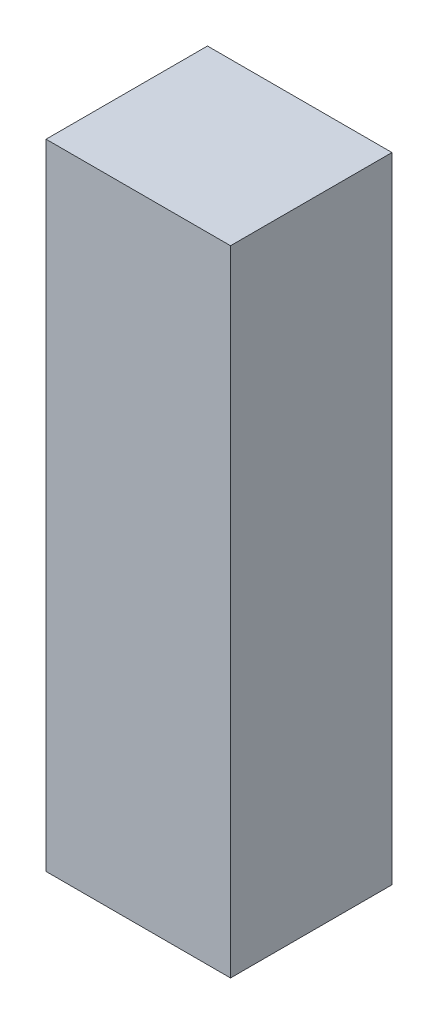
ISO-10303-21;
HEADER;
FILE_DESCRIPTION(('STEP AP214'),'2;1');
FILE_NAME('part.step','',(''),(''),'','','');
FILE_SCHEMA(('AUTOMOTIVE_DESIGN { 1 0 10303 214 1 1 1 1 }'));
ENDSEC;
DATA;
#1=APPLICATION_CONTEXT('core data for automotive mechanical design processes');
#2=APPLICATION_PROTOCOL_DEFINITION('international standard','automotive_design',2000,#1);
#3=PRODUCT_CONTEXT('',#1,'mechanical');
#4=PRODUCT('Part','Part','',(#3));
#5=PRODUCT_RELATED_PRODUCT_CATEGORY('part','',(#4));
#6=PRODUCT_DEFINITION_FORMATION('','',#4);
#7=PRODUCT_DEFINITION_CONTEXT('part definition',#1,'design');
#8=PRODUCT_DEFINITION('design','',#6,#7);
#9=PRODUCT_DEFINITION_SHAPE('','',#8);
#10=(LENGTH_UNIT() NAMED_UNIT(*) SI_UNIT(.MILLI.,.METRE.));
#11=(NAMED_UNIT(*) PLANE_ANGLE_UNIT() SI_UNIT($,.RADIAN.));
#12=(NAMED_UNIT(*) SI_UNIT($,.STERADIAN.) SOLID_ANGLE_UNIT());
#13=UNCERTAINTY_MEASURE_WITH_UNIT(LENGTH_MEASURE(1.E-05),#10,'distance_accuracy_value','');
#14=(GEOMETRIC_REPRESENTATION_CONTEXT(3) GLOBAL_UNCERTAINTY_ASSIGNED_CONTEXT((#13)) GLOBAL_UNIT_ASSIGNED_CONTEXT((#10,
#11,#12)) REPRESENTATION_CONTEXT('',''));
#15=CARTESIAN_POINT('',(0.,0.,0.));
#16=DIRECTION('',(0.,0.,1.));
#17=DIRECTION('',(1.,0.,0.));
#18=AXIS2_PLACEMENT_3D('',#15,#16,#17);
#19=CARTESIAN_POINT('',(25.4,174.625,-22.225));
#20=DIRECTION('',(-1.,0.,0.));
#21=DIRECTION('',(0.,0.,1.));
#22=AXIS2_PLACEMENT_3D('',#19,#20,#21);
#23=PLANE('',#22);
#24=DIRECTION('',(0.,0.,-1.));
#25=VECTOR('',#24,1.);
#26=CARTESIAN_POINT('',(25.4,0.,-22.225));
#27=LINE('',#26,#25);
#28=CARTESIAN_POINT('',(25.4,0.,22.225));
#29=VERTEX_POINT('',#28);
#30=CARTESIAN_POINT('',(25.4,0.,-22.225));
#31=VERTEX_POINT('',#30);
#32=EDGE_CURVE('E121',#29,#31,#27,.T.);
#33=ORIENTED_EDGE('',*,*,#32,.T.);
#34=DIRECTION('',(0.,-1.,0.));
#35=VECTOR('',#34,1.);
#36=CARTESIAN_POINT('',(25.4,174.625,-22.225));
#37=LINE('',#36,#35);
#38=CARTESIAN_POINT('',(25.4,174.625,-22.225));
#39=VERTEX_POINT('',#38);
#40=EDGE_CURVE('E11',#39,#31,#37,.T.);
#41=ORIENTED_EDGE('',*,*,#40,.F.);
#42=DIRECTION('',(0.,0.,-1.));
#43=VECTOR('',#42,1.);
#44=CARTESIAN_POINT('',(25.4,174.625,-22.225));
#45=LINE('',#44,#43);
#46=CARTESIAN_POINT('',(25.4,174.625,22.225));
#47=VERTEX_POINT('',#46);
#48=EDGE_CURVE('E122',#47,#39,#45,.T.);
#49=ORIENTED_EDGE('',*,*,#48,.F.);
#50=DIRECTION('',(0.,-1.,0.));
#51=VECTOR('',#50,1.);
#52=CARTESIAN_POINT('',(25.4,174.625,22.225));
#53=LINE('',#52,#51);
#54=EDGE_CURVE('E128',#47,#29,#53,.T.);
#55=ORIENTED_EDGE('',*,*,#54,.T.);
#56=EDGE_LOOP('',(#33,#41,#49,#55));
#57=FACE_BOUND('',#56,.T.);
#58=ADVANCED_FACE('F37',(#57),#23,.F.);
#59=CARTESIAN_POINT('',(-25.4,174.625,-22.225));
#60=DIRECTION('',(0.,0.,1.));
#61=DIRECTION('',(1.,0.,0.));
#62=AXIS2_PLACEMENT_3D('',#59,#60,#61);
#63=PLANE('',#62);
#64=CARTESIAN_POINT('',(19.05,165.1,-22.225));
#65=DIRECTION('',(0.,0.,-1.));
#66=DIRECTION('',(-1.,0.,0.));
#67=AXIS2_PLACEMENT_3D('',#64,#65,#66);
#68=CIRCLE('',#67,2.7051);
#69=CARTESIAN_POINT('',(16.3449,165.1,-22.225));
#70=VERTEX_POINT('',#69);
#71=EDGE_CURVE('E105',#70,#70,#68,.T.);
#72=ORIENTED_EDGE('',*,*,#71,.F.);
#73=EDGE_LOOP('',(#72));
#74=FACE_BOUND('',#73,.T.);
#75=CARTESIAN_POINT('',(-19.05,165.1,-22.225));
#76=DIRECTION('',(0.,0.,-1.));
#77=DIRECTION('',(-1.,0.,0.));
#78=AXIS2_PLACEMENT_3D('',#75,#76,#77);
#79=CIRCLE('',#78,2.7051);
#80=CARTESIAN_POINT('',(-21.7551,165.1,-22.225));
#81=VERTEX_POINT('',#80);
#82=EDGE_CURVE('E104',#81,#81,#79,.T.);
#83=ORIENTED_EDGE('',*,*,#82,.F.);
#84=EDGE_LOOP('',(#83));
#85=FACE_BOUND('',#84,.T.);
#86=DIRECTION('',(-1.,0.,0.));
#87=VECTOR('',#86,1.);
#88=CARTESIAN_POINT('',(-25.4,0.,-22.225));
#89=LINE('',#88,#87);
#90=CARTESIAN_POINT('',(-25.4,0.,-22.225));
#91=VERTEX_POINT('',#90);
#92=EDGE_CURVE('E131',#31,#91,#89,.T.);
#93=ORIENTED_EDGE('',*,*,#92,.T.);
#94=DIRECTION('',(0.,-1.,0.));
#95=VECTOR('',#94,1.);
#96=CARTESIAN_POINT('',(-25.4,174.625,-22.225));
#97=LINE('',#96,#95);
#98=CARTESIAN_POINT('',(-25.4,174.625,-22.225));
#99=VERTEX_POINT('',#98);
#100=EDGE_CURVE('E45',#99,#91,#97,.T.);
#101=ORIENTED_EDGE('',*,*,#100,.F.);
#102=DIRECTION('',(-1.,0.,0.));
#103=VECTOR('',#102,1.);
#104=CARTESIAN_POINT('',(-25.4,174.625,-22.225));
#105=LINE('',#104,#103);
#106=EDGE_CURVE('E84',#39,#99,#105,.T.);
#107=ORIENTED_EDGE('',*,*,#106,.F.);
#108=ORIENTED_EDGE('',*,*,#40,.T.);
#109=EDGE_LOOP('',(#93,#101,#107,#108));
#110=FACE_BOUND('',#109,.T.);
#111=ADVANCED_FACE('F154',(#74,#85,#110),#63,.F.);
#112=CARTESIAN_POINT('',(-25.4,174.625,-22.225));
#113=DIRECTION('',(1.,0.,0.));
#114=DIRECTION('',(0.,0.,-1.));
#115=AXIS2_PLACEMENT_3D('',#112,#113,#114);
#116=PLANE('',#115);
#117=DIRECTION('',(0.,0.,1.));
#118=VECTOR('',#117,1.);
#119=CARTESIAN_POINT('',(-25.4,0.,-22.225));
#120=LINE('',#119,#118);
#121=CARTESIAN_POINT('',(-25.4,0.,22.225));
#122=VERTEX_POINT('',#121);
#123=EDGE_CURVE('E71',#91,#122,#120,.T.);
#124=ORIENTED_EDGE('',*,*,#123,.T.);
#125=DIRECTION('',(0.,-1.,0.));
#126=VECTOR('',#125,1.);
#127=CARTESIAN_POINT('',(-25.4,174.625,22.225));
#128=LINE('',#127,#126);
#129=CARTESIAN_POINT('',(-25.4,174.625,22.225));
#130=VERTEX_POINT('',#129);
#131=EDGE_CURVE('E136',#130,#122,#128,.T.);
#132=ORIENTED_EDGE('',*,*,#131,.F.);
#133=DIRECTION('',(0.,0.,1.));
#134=VECTOR('',#133,1.);
#135=CARTESIAN_POINT('',(-25.4,174.625,-22.225));
#136=LINE('',#135,#134);
#137=EDGE_CURVE('E125',#99,#130,#136,.T.);
#138=ORIENTED_EDGE('',*,*,#137,.F.);
#139=ORIENTED_EDGE('',*,*,#100,.T.);
#140=EDGE_LOOP('',(#124,#132,#138,#139));
#141=FACE_BOUND('',#140,.T.);
#142=ADVANCED_FACE('F138',(#141),#116,.F.);
#143=CARTESIAN_POINT('',(-25.4,174.625,22.225));
#144=DIRECTION('',(0.,0.,-1.));
#145=DIRECTION('',(-1.,0.,0.));
#146=AXIS2_PLACEMENT_3D('',#143,#144,#145);
#147=PLANE('',#146);
#148=DIRECTION('',(1.,0.,0.));
#149=VECTOR('',#148,1.);
#150=CARTESIAN_POINT('',(-25.4,0.,22.225));
#151=LINE('',#150,#149);
#152=EDGE_CURVE('E77',#122,#29,#151,.T.);
#153=ORIENTED_EDGE('',*,*,#152,.T.);
#154=ORIENTED_EDGE('',*,*,#54,.F.);
#155=DIRECTION('',(1.,0.,0.));
#156=VECTOR('',#155,1.);
#157=CARTESIAN_POINT('',(-25.4,174.625,22.225));
#158=LINE('',#157,#156);
#159=EDGE_CURVE('E53',#130,#47,#158,.T.);
#160=ORIENTED_EDGE('',*,*,#159,.F.);
#161=ORIENTED_EDGE('',*,*,#131,.T.);
#162=EDGE_LOOP('',(#153,#154,#160,#161));
#163=FACE_BOUND('',#162,.T.);
#164=ADVANCED_FACE('F145',(#163),#147,.F.);
#165=CARTESIAN_POINT('',(0.,174.625,0.));
#166=DIRECTION('',(0.,1.,0.));
#167=DIRECTION('',(0.,0.,1.));
#168=AXIS2_PLACEMENT_3D('',#165,#166,#167);
#169=PLANE('',#168);
#170=ORIENTED_EDGE('',*,*,#48,.T.);
#171=ORIENTED_EDGE('',*,*,#106,.T.);
#172=ORIENTED_EDGE('',*,*,#137,.T.);
#173=ORIENTED_EDGE('',*,*,#159,.T.);
#174=EDGE_LOOP('',(#170,#171,#172,#173));
#175=FACE_BOUND('',#174,.T.);
#176=ADVANCED_FACE('F147',(#175),#169,.T.);
#177=CARTESIAN_POINT('',(0.,0.,0.));
#178=DIRECTION('',(0.,1.,0.));
#179=DIRECTION('',(0.,0.,1.));
#180=AXIS2_PLACEMENT_3D('',#177,#178,#179);
#181=PLANE('',#180);
#182=CARTESIAN_POINT('',(0.,0.,4.44499999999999));
#183=DIRECTION('',(0.,-1.,0.));
#184=DIRECTION('',(0.,0.,-1.));
#185=AXIS2_PLACEMENT_3D('',#182,#183,#184);
#186=CIRCLE('',#185,3.26389999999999);
#187=CARTESIAN_POINT('',(0.,0.,1.1811));
#188=VERTEX_POINT('',#187);
#189=EDGE_CURVE('E115',#188,#188,#186,.T.);
#190=ORIENTED_EDGE('',*,*,#189,.F.);
#191=EDGE_LOOP('',(#190));
#192=FACE_BOUND('',#191,.T.);
#193=ORIENTED_EDGE('',*,*,#32,.F.);
#194=ORIENTED_EDGE('',*,*,#152,.F.);
#195=ORIENTED_EDGE('',*,*,#123,.F.);
#196=ORIENTED_EDGE('',*,*,#92,.F.);
#197=EDGE_LOOP('',(#193,#194,#195,#196));
#198=FACE_BOUND('',#197,.T.);
#199=ADVANCED_FACE('F141',(#192,#198),#181,.F.);
#200=CARTESIAN_POINT('',(0.,20.1168,4.44499999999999));
#201=DIRECTION('',(0.,-1.,0.));
#202=DIRECTION('',(0.,0.,-1.));
#203=AXIS2_PLACEMENT_3D('',#200,#201,#202);
#204=CONICAL_SURFACE('',#203,3.26389999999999,1.02974425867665);
#205=CARTESIAN_POINT('',(0.,22.0779489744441,4.44499999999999));
#206=VERTEX_POINT('',#205);
#207=VERTEX_LOOP('',#206);
#208=FACE_BOUND('',#207,.T.);
#209=CARTESIAN_POINT('',(0.,20.1168,4.44499999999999));
#210=DIRECTION('',(0.,-1.,0.));
#211=DIRECTION('',(0.,0.,-1.));
#212=AXIS2_PLACEMENT_3D('',#209,#210,#211);
#213=CIRCLE('',#212,3.26389999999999);
#214=CARTESIAN_POINT('',(0.,20.1168,1.1811));
#215=VERTEX_POINT('',#214);
#216=EDGE_CURVE('E118',#215,#215,#213,.T.);
#217=ORIENTED_EDGE('',*,*,#216,.T.);
#218=EDGE_LOOP('',(#217));
#219=FACE_BOUND('',#218,.T.);
#220=ADVANCED_FACE('F185',(#208,#219),#204,.F.);
#221=CARTESIAN_POINT('',(0.,0.,4.44499999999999));
#222=DIRECTION('',(0.,-1.,0.));
#223=DIRECTION('',(0.,0.,-1.));
#224=AXIS2_PLACEMENT_3D('',#221,#222,#223);
#225=CYLINDRICAL_SURFACE('',#224,3.26389999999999);
#226=ORIENTED_EDGE('',*,*,#216,.F.);
#227=EDGE_LOOP('',(#226));
#228=FACE_BOUND('',#227,.T.);
#229=ORIENTED_EDGE('',*,*,#189,.T.);
#230=EDGE_LOOP('',(#229));
#231=FACE_BOUND('',#230,.T.);
#232=ADVANCED_FACE('F177',(#228,#231),#225,.F.);
#233=CARTESIAN_POINT('',(-19.05,165.1,-6.80720000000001));
#234=DIRECTION('',(0.,0.,-1.));
#235=DIRECTION('',(-1.,0.,0.));
#236=AXIS2_PLACEMENT_3D('',#233,#234,#235);
#237=CONICAL_SURFACE('',#236,2.70509999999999,1.02974425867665);
#238=CARTESIAN_POINT('',(-19.05,165.1,-5.18181193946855));
#239=VERTEX_POINT('',#238);
#240=VERTEX_LOOP('',#239);
#241=FACE_BOUND('',#240,.T.);
#242=CARTESIAN_POINT('',(-19.05,165.1,-6.80720000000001));
#243=DIRECTION('',(0.,0.,-1.));
#244=DIRECTION('',(-1.,0.,0.));
#245=AXIS2_PLACEMENT_3D('',#242,#243,#244);
#246=CIRCLE('',#245,2.70509999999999);
#247=CARTESIAN_POINT('',(-21.7551,165.1,-6.80720000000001));
#248=VERTEX_POINT('',#247);
#249=EDGE_CURVE('E108',#248,#248,#246,.T.);
#250=ORIENTED_EDGE('',*,*,#249,.T.);
#251=EDGE_LOOP('',(#250));
#252=FACE_BOUND('',#251,.T.);
#253=ADVANCED_FACE('F171',(#241,#252),#237,.F.);
#254=CARTESIAN_POINT('',(-19.05,165.1,-22.225));
#255=DIRECTION('',(0.,0.,-1.));
#256=DIRECTION('',(-1.,0.,0.));
#257=AXIS2_PLACEMENT_3D('',#254,#255,#256);
#258=CYLINDRICAL_SURFACE('',#257,2.7051);
#259=ORIENTED_EDGE('',*,*,#249,.F.);
#260=EDGE_LOOP('',(#259));
#261=FACE_BOUND('',#260,.T.);
#262=ORIENTED_EDGE('',*,*,#82,.T.);
#263=EDGE_LOOP('',(#262));
#264=FACE_BOUND('',#263,.T.);
#265=ADVANCED_FACE('F98',(#261,#264),#258,.F.);
#266=CARTESIAN_POINT('',(19.05,165.1,-6.80720000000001));
#267=DIRECTION('',(0.,0.,-1.));
#268=DIRECTION('',(-1.,0.,0.));
#269=AXIS2_PLACEMENT_3D('',#266,#267,#268);
#270=CONICAL_SURFACE('',#269,2.70509999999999,1.02974425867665);
#271=CARTESIAN_POINT('',(19.05,165.1,-5.18181193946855));
#272=VERTEX_POINT('',#271);
#273=VERTEX_LOOP('',#272);
#274=FACE_BOUND('',#273,.T.);
#275=CARTESIAN_POINT('',(19.05,165.1,-6.80720000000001));
#276=DIRECTION('',(0.,0.,-1.));
#277=DIRECTION('',(-1.,0.,0.));
#278=AXIS2_PLACEMENT_3D('',#275,#276,#277);
#279=CIRCLE('',#278,2.70509999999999);
#280=CARTESIAN_POINT('',(16.3449,165.1,-6.80720000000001));
#281=VERTEX_POINT('',#280);
#282=EDGE_CURVE('E102',#281,#281,#279,.T.);
#283=ORIENTED_EDGE('',*,*,#282,.T.);
#284=EDGE_LOOP('',(#283));
#285=FACE_BOUND('',#284,.T.);
#286=ADVANCED_FACE('F94',(#274,#285),#270,.F.);
#287=CARTESIAN_POINT('',(19.05,165.1,-22.225));
#288=DIRECTION('',(0.,0.,-1.));
#289=DIRECTION('',(-1.,0.,0.));
#290=AXIS2_PLACEMENT_3D('',#287,#288,#289);
#291=CYLINDRICAL_SURFACE('',#290,2.7051);
#292=ORIENTED_EDGE('',*,*,#282,.F.);
#293=EDGE_LOOP('',(#292));
#294=FACE_BOUND('',#293,.T.);
#295=ORIENTED_EDGE('',*,*,#71,.T.);
#296=EDGE_LOOP('',(#295));
#297=FACE_BOUND('',#296,.T.);
#298=ADVANCED_FACE('F97',(#294,#297),#291,.F.);
#299=CLOSED_SHELL('',(#58,#111,#142,#164,#176,#199,#220,#232,#253,#265,#286,#298));
#300=MANIFOLD_SOLID_BREP('B2',#299);
#301=ADVANCED_BREP_SHAPE_REPRESENTATION('',(#18,#300),#14);
#302=SHAPE_DEFINITION_REPRESENTATION(#9,#301);
ENDSEC;
END-ISO-10303-21;
